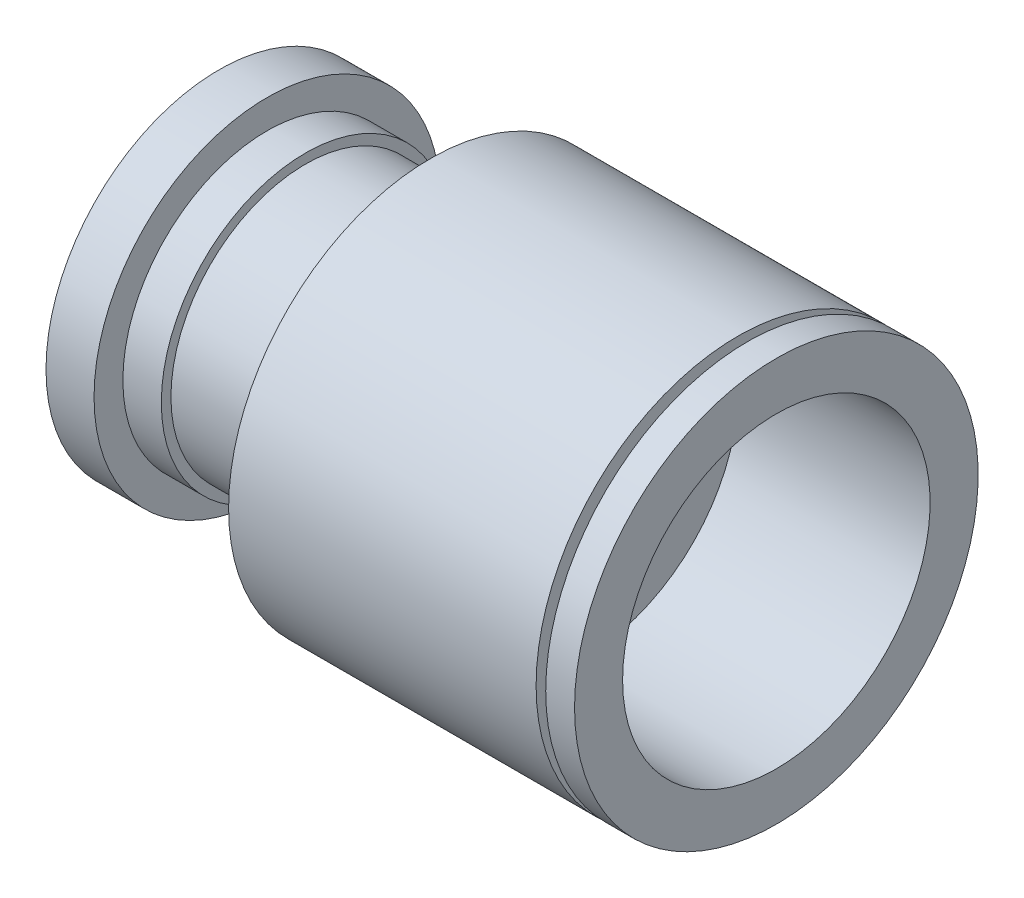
from build123d import *


with BuildPart() as part:
    # Esquisse1 → base (revolve)
    with BuildSketch(Plane.XY, mode=Mode.PRIVATE) as base_sk:
        Polygon((0, 11), (38, 11), (38, 16), (58, 16), (58, 21), (55, 21), (55, 19), (54, 19), (54, 21), (22, 21), (22, 15), (18, 15), (18, 14), (9, 14), (9, 15), (5, 15), (5, 18), (0, 18), align=None)
    revolve(base_sk.sketch.rotate(Axis((0, 0, 0), (1, 0, 0)), 90), axis=Axis((0, 0, 0), (1, 0, 0)))


solid = part.part
